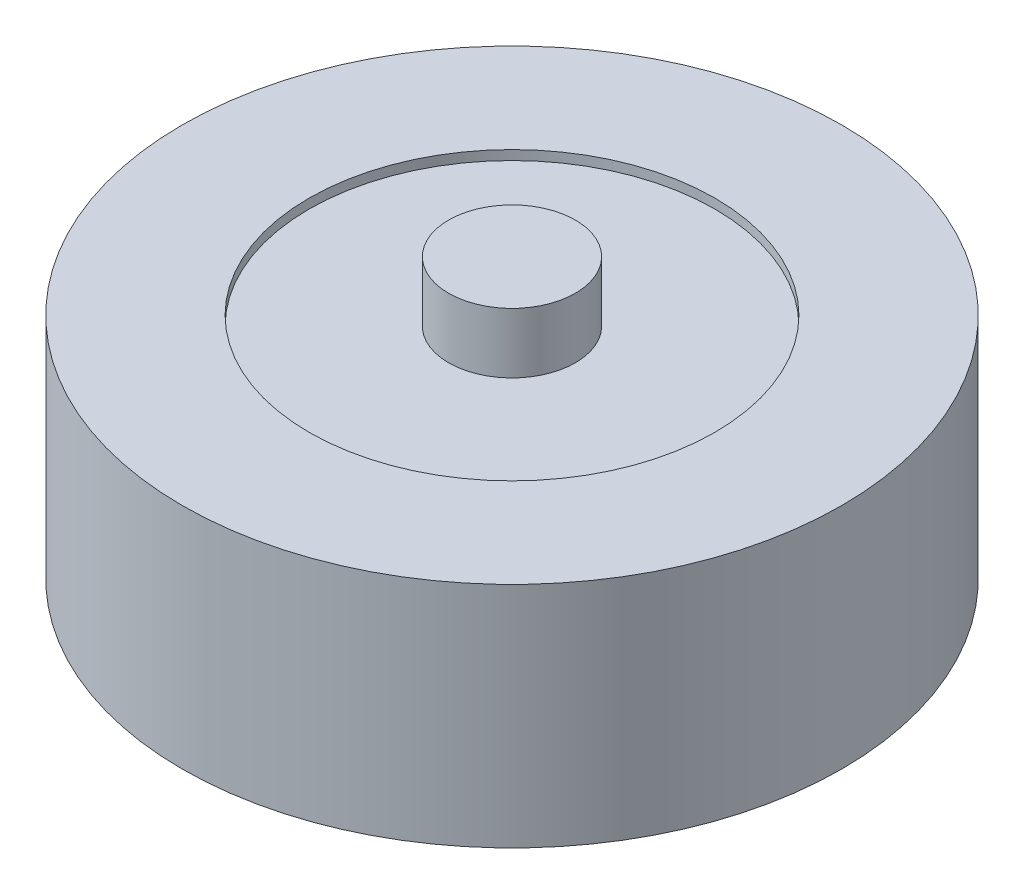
from build123d import *

# Parameters (mm, degrees)
SKETCH1_R         = 26
EXTRUDE1_DEPTH    = 18
SKETCH2_R         = 16
EXTRUDE2_DEPTH    = 0.75
SKETCH3_R         = 5
EXTRUDE3_DEPTH    = 4.75
CIRPATTERN1_COUNT = 4


with BuildPart() as part:
    # Sketch1 → Extrude1 (new body)
    with BuildSketch(Plane(origin=(0, 0, 0), x_dir=(1, 0, 0), z_dir=(0, 1, 0))):
        with Locations(Location((0, 0, 0), (0, 0, 270))):
            Circle(SKETCH1_R)
    extrude(amount=EXTRUDE1_DEPTH)

    # Sketch2 → Extrude2 (cut)
    with BuildSketch(Plane(origin=(0, 18, 0), x_dir=(1, 0, 0), z_dir=(0, 1, 0))):
        with Locations(Location((0, 0, 0), (0, 0, 270))):
            Circle(SKETCH2_R)
    extrude(amount=-EXTRUDE2_DEPTH, mode=Mode.SUBTRACT)

    # Sketch3 → Extrude3 (add)
    with BuildSketch(Plane(origin=(0, 17.25, 0), x_dir=(1, 0, 0), z_dir=(0, 1, 0))):
        with Locations(Location((0, 0, 0), (0, 0, 270))):
            Circle(SKETCH3_R)
    extrude(amount=EXTRUDE3_DEPTH)

    # Sketch4 → M5x0.8 Tapped Hole1 (revolve, cut)
    with BuildSketch(Plane(origin=(-15.556349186, 0, -15.556349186), x_dir=(0, 0, -1), z_dir=(1, 0, 0))):
        Polygon((0, 0), (0, 11.6618073), (2.1, 10.4), (2.1, 0), align=None)
    m5x0_8_tapped_hole1 = revolve(axis=Axis((-15.556349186, -6.35, -15.556349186), (0, 1, 0)), mode=Mode.SUBTRACT)

    # CirPattern1: M5x0.8 Tapped Hole1 ×4 about axis
    cirpattern1_axis = Axis((0, 0, 0), (0, 1, 0))
    for i in range(1, CIRPATTERN1_COUNT):
        add(m5x0_8_tapped_hole1.rotate(cirpattern1_axis, i * 360 / CIRPATTERN1_COUNT), mode=Mode.SUBTRACT)


solid = part.part
